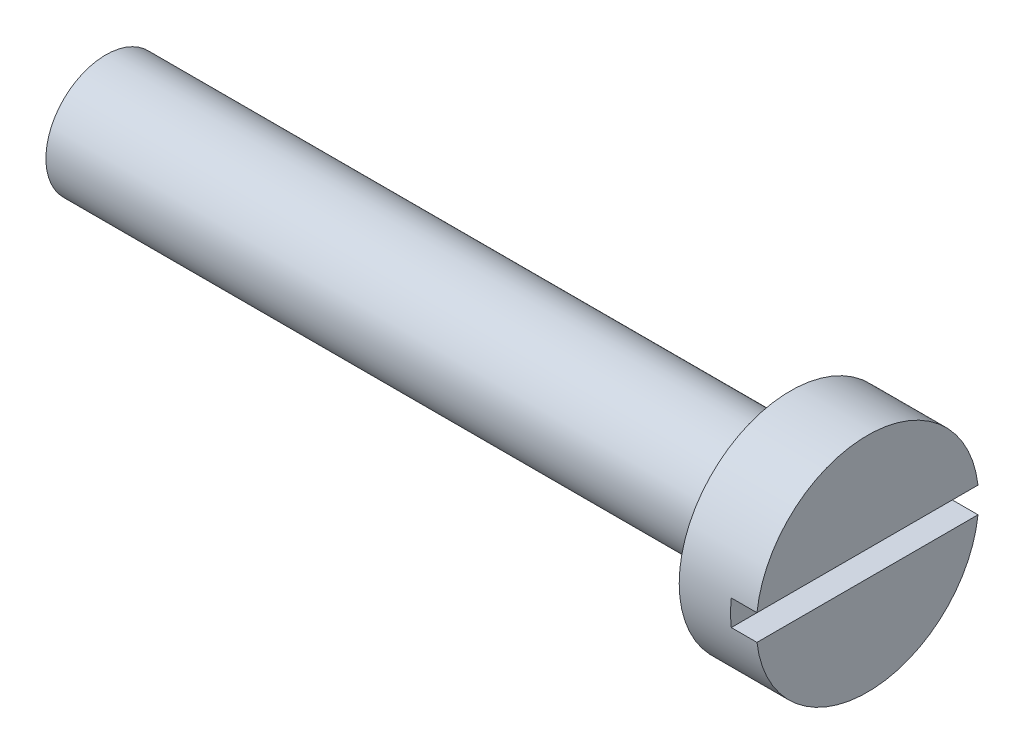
ISO-10303-21;
HEADER;
FILE_DESCRIPTION(('STEP AP214'),'2;1');
FILE_NAME('part.step','',(''),(''),'','','');
FILE_SCHEMA(('AUTOMOTIVE_DESIGN { 1 0 10303 214 1 1 1 1 }'));
ENDSEC;
DATA;
#1=APPLICATION_CONTEXT('core data for automotive mechanical design processes');
#2=APPLICATION_PROTOCOL_DEFINITION('international standard','automotive_design',2000,#1);
#3=PRODUCT_CONTEXT('',#1,'mechanical');
#4=PRODUCT('Part','Part','',(#3));
#5=PRODUCT_RELATED_PRODUCT_CATEGORY('part','',(#4));
#6=PRODUCT_DEFINITION_FORMATION('','',#4);
#7=PRODUCT_DEFINITION_CONTEXT('part definition',#1,'design');
#8=PRODUCT_DEFINITION('design','',#6,#7);
#9=PRODUCT_DEFINITION_SHAPE('','',#8);
#10=(LENGTH_UNIT() NAMED_UNIT(*) SI_UNIT(.MILLI.,.METRE.));
#11=(NAMED_UNIT(*) PLANE_ANGLE_UNIT() SI_UNIT($,.RADIAN.));
#12=(NAMED_UNIT(*) SI_UNIT($,.STERADIAN.) SOLID_ANGLE_UNIT());
#13=UNCERTAINTY_MEASURE_WITH_UNIT(LENGTH_MEASURE(1.E-05),#10,'distance_accuracy_value','');
#14=(GEOMETRIC_REPRESENTATION_CONTEXT(3) GLOBAL_UNCERTAINTY_ASSIGNED_CONTEXT((#13)) GLOBAL_UNIT_ASSIGNED_CONTEXT((#10,
#11,#12)) REPRESENTATION_CONTEXT('',''));
#15=CARTESIAN_POINT('',(0.,0.,0.));
#16=DIRECTION('',(0.,0.,1.));
#17=DIRECTION('',(1.,0.,0.));
#18=AXIS2_PLACEMENT_3D('',#15,#16,#17);
#19=CARTESIAN_POINT('',(0.,0.,0.));
#20=DIRECTION('',(1.,0.,0.));
#21=DIRECTION('',(0.,0.,-1.));
#22=AXIS2_PLACEMENT_3D('',#19,#20,#21);
#23=PLANE('',#22);
#24=DIRECTION('',(0.,0.,1.));
#25=VECTOR('',#24,1.);
#26=CARTESIAN_POINT('',(0.,0.15,-1.3));
#27=LINE('',#26,#25);
#28=CARTESIAN_POINT('',(0.,0.15,-1.2913171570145));
#29=VERTEX_POINT('',#28);
#30=CARTESIAN_POINT('',(0.,0.15,1.2913171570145));
#31=VERTEX_POINT('',#30);
#32=EDGE_CURVE('E84',#29,#31,#27,.T.);
#33=ORIENTED_EDGE('',*,*,#32,.F.);
#34=CARTESIAN_POINT('',(0.,0.,0.));
#35=DIRECTION('',(1.,0.,0.));
#36=DIRECTION('',(0.,0.,-1.));
#37=AXIS2_PLACEMENT_3D('',#34,#35,#36);
#38=CIRCLE('',#37,1.3);
#39=EDGE_CURVE('E93',#29,#31,#38,.T.);
#40=ORIENTED_EDGE('',*,*,#39,.T.);
#41=EDGE_LOOP('',(#33,#40));
#42=FACE_BOUND('',#41,.T.);
#43=ADVANCED_FACE('F35',(#42),#23,.T.);
#44=DIRECTION('',(0.,0.,1.));
#45=VECTOR('',#44,1.);
#46=CARTESIAN_POINT('',(0.,-0.15,-1.3));
#47=LINE('',#46,#45);
#48=CARTESIAN_POINT('',(0.,-0.15,-1.2913171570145));
#49=VERTEX_POINT('',#48);
#50=CARTESIAN_POINT('',(0.,-0.15,1.2913171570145));
#51=VERTEX_POINT('',#50);
#52=EDGE_CURVE('E77',#49,#51,#47,.T.);
#53=ORIENTED_EDGE('',*,*,#52,.T.);
#54=EDGE_CURVE('E90',#51,#49,#38,.T.);
#55=ORIENTED_EDGE('',*,*,#54,.T.);
#56=EDGE_LOOP('',(#53,#55));
#57=FACE_BOUND('',#56,.T.);
#58=ADVANCED_FACE('F37',(#57),#23,.T.);
#59=CARTESIAN_POINT('',(0.,0.,0.));
#60=DIRECTION('',(1.,0.,0.));
#61=DIRECTION('',(0.,0.,-1.));
#62=AXIS2_PLACEMENT_3D('',#59,#60,#61);
#63=CYLINDRICAL_SURFACE('',#62,1.3);
#64=CARTESIAN_POINT('',(-0.3,0.,0.));
#65=DIRECTION('',(-1.,0.,0.));
#66=DIRECTION('',(0.,0.,1.));
#67=AXIS2_PLACEMENT_3D('',#64,#65,#66);
#68=CIRCLE('',#67,1.3);
#69=CARTESIAN_POINT('',(-0.3,-0.15,-1.2913171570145));
#70=VERTEX_POINT('',#69);
#71=CARTESIAN_POINT('',(-0.3,0.15,-1.2913171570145));
#72=VERTEX_POINT('',#71);
#73=EDGE_CURVE('E92',#70,#72,#68,.F.);
#74=ORIENTED_EDGE('',*,*,#73,.F.);
#75=DIRECTION('',(1.,0.,0.));
#76=VECTOR('',#75,1.);
#77=CARTESIAN_POINT('',(0.,-0.15,-1.2913171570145));
#78=LINE('',#77,#76);
#79=EDGE_CURVE('E11',#49,#70,#78,.F.);
#80=ORIENTED_EDGE('',*,*,#79,.F.);
#81=ORIENTED_EDGE('',*,*,#54,.F.);
#82=DIRECTION('',(1.,0.,0.));
#83=VECTOR('',#82,1.);
#84=CARTESIAN_POINT('',(0.,-0.15,1.2913171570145));
#85=LINE('',#84,#83);
#86=CARTESIAN_POINT('',(-0.3,-0.15,1.2913171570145));
#87=VERTEX_POINT('',#86);
#88=EDGE_CURVE('E43',#87,#51,#85,.T.);
#89=ORIENTED_EDGE('',*,*,#88,.F.);
#90=CARTESIAN_POINT('',(-0.3,0.15,1.2913171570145));
#91=VERTEX_POINT('',#90);
#92=EDGE_CURVE('E50',#91,#87,#68,.F.);
#93=ORIENTED_EDGE('',*,*,#92,.F.);
#94=DIRECTION('',(1.,0.,0.));
#95=VECTOR('',#94,1.);
#96=CARTESIAN_POINT('',(0.,0.15,1.2913171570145));
#97=LINE('',#96,#95);
#98=EDGE_CURVE('E58',#31,#91,#97,.F.);
#99=ORIENTED_EDGE('',*,*,#98,.F.);
#100=ORIENTED_EDGE('',*,*,#39,.F.);
#101=DIRECTION('',(1.,0.,0.));
#102=VECTOR('',#101,1.);
#103=CARTESIAN_POINT('',(0.,0.15,-1.2913171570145));
#104=LINE('',#103,#102);
#105=EDGE_CURVE('E104',#72,#29,#104,.T.);
#106=ORIENTED_EDGE('',*,*,#105,.F.);
#107=EDGE_LOOP('',(#74,#80,#81,#89,#93,#99,#100,#106));
#108=FACE_BOUND('',#107,.T.);
#109=CARTESIAN_POINT('',(-0.9,0.,0.));
#110=DIRECTION('',(1.,0.,0.));
#111=DIRECTION('',(0.,0.,-1.));
#112=AXIS2_PLACEMENT_3D('',#109,#110,#111);
#113=CIRCLE('',#112,1.3);
#114=CARTESIAN_POINT('',(-0.9,0.,-1.3));
#115=VERTEX_POINT('',#114);
#116=EDGE_CURVE('E94',#115,#115,#113,.T.);
#117=ORIENTED_EDGE('',*,*,#116,.T.);
#118=EDGE_LOOP('',(#117));
#119=FACE_BOUND('',#118,.T.);
#120=ADVANCED_FACE('F88',(#108,#119),#63,.T.);
#121=CARTESIAN_POINT('',(-0.9,1.3,0.));
#122=DIRECTION('',(-1.,0.,0.));
#123=DIRECTION('',(0.,0.,1.));
#124=AXIS2_PLACEMENT_3D('',#121,#122,#123);
#125=PLANE('',#124);
#126=CARTESIAN_POINT('',(-0.9,0.,0.));
#127=DIRECTION('',(1.,0.,0.));
#128=DIRECTION('',(0.,0.,-1.));
#129=AXIS2_PLACEMENT_3D('',#126,#127,#128);
#130=CIRCLE('',#129,0.7);
#131=CARTESIAN_POINT('',(-0.9,0.,-0.7));
#132=VERTEX_POINT('',#131);
#133=EDGE_CURVE('E98',#132,#132,#130,.T.);
#134=ORIENTED_EDGE('',*,*,#133,.T.);
#135=EDGE_LOOP('',(#134));
#136=FACE_BOUND('',#135,.T.);
#137=ORIENTED_EDGE('',*,*,#116,.F.);
#138=EDGE_LOOP('',(#137));
#139=FACE_BOUND('',#138,.T.);
#140=ADVANCED_FACE('F120',(#136,#139),#125,.T.);
#141=CARTESIAN_POINT('',(0.,0.,0.));
#142=DIRECTION('',(1.,0.,0.));
#143=DIRECTION('',(0.,0.,-1.));
#144=AXIS2_PLACEMENT_3D('',#141,#142,#143);
#145=CYLINDRICAL_SURFACE('',#144,0.699999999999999);
#146=CARTESIAN_POINT('',(-8.9,0.,0.));
#147=DIRECTION('',(1.,0.,0.));
#148=DIRECTION('',(0.,0.,-1.));
#149=AXIS2_PLACEMENT_3D('',#146,#147,#148);
#150=CIRCLE('',#149,0.699999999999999);
#151=CARTESIAN_POINT('',(-8.9,0.,-0.699999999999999));
#152=VERTEX_POINT('',#151);
#153=EDGE_CURVE('E109',#152,#152,#150,.T.);
#154=ORIENTED_EDGE('',*,*,#153,.T.);
#155=EDGE_LOOP('',(#154));
#156=FACE_BOUND('',#155,.T.);
#157=ORIENTED_EDGE('',*,*,#133,.F.);
#158=EDGE_LOOP('',(#157));
#159=FACE_BOUND('',#158,.T.);
#160=ADVANCED_FACE('F123',(#156,#159),#145,.T.);
#161=CARTESIAN_POINT('',(-8.9,0.699999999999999,0.));
#162=DIRECTION('',(-1.,0.,0.));
#163=DIRECTION('',(0.,0.,1.));
#164=AXIS2_PLACEMENT_3D('',#161,#162,#163);
#165=PLANE('',#164);
#166=ORIENTED_EDGE('',*,*,#153,.F.);
#167=EDGE_LOOP('',(#166));
#168=FACE_BOUND('',#167,.T.);
#169=ADVANCED_FACE('F125',(#168),#165,.T.);
#170=CARTESIAN_POINT('',(-0.3,0.15,-1.3));
#171=DIRECTION('',(-1.,0.,0.));
#172=DIRECTION('',(0.,0.,1.));
#173=AXIS2_PLACEMENT_3D('',#170,#171,#172);
#174=PLANE('',#173);
#175=DIRECTION('',(0.,0.,1.));
#176=VECTOR('',#175,1.);
#177=CARTESIAN_POINT('',(-0.3,-0.15,-1.3));
#178=LINE('',#177,#176);
#179=EDGE_CURVE('E85',#70,#87,#178,.T.);
#180=ORIENTED_EDGE('',*,*,#179,.F.);
#181=ORIENTED_EDGE('',*,*,#73,.T.);
#182=DIRECTION('',(0.,0.,1.));
#183=VECTOR('',#182,1.);
#184=CARTESIAN_POINT('',(-0.3,0.15,-1.3));
#185=LINE('',#184,#183);
#186=EDGE_CURVE('E107',#72,#91,#185,.T.);
#187=ORIENTED_EDGE('',*,*,#186,.T.);
#188=ORIENTED_EDGE('',*,*,#92,.T.);
#189=EDGE_LOOP('',(#180,#181,#187,#188));
#190=FACE_BOUND('',#189,.T.);
#191=ADVANCED_FACE('F106',(#190),#174,.F.);
#192=CARTESIAN_POINT('',(-0.3,0.15,-1.3));
#193=DIRECTION('',(0.,1.,0.));
#194=DIRECTION('',(-1.,0.,0.));
#195=AXIS2_PLACEMENT_3D('',#192,#193,#194);
#196=PLANE('',#195);
#197=ORIENTED_EDGE('',*,*,#98,.T.);
#198=ORIENTED_EDGE('',*,*,#186,.F.);
#199=ORIENTED_EDGE('',*,*,#105,.T.);
#200=ORIENTED_EDGE('',*,*,#32,.T.);
#201=EDGE_LOOP('',(#197,#198,#199,#200));
#202=FACE_BOUND('',#201,.T.);
#203=ADVANCED_FACE('F108',(#202),#196,.F.);
#204=CARTESIAN_POINT('',(-0.3,-0.15,-1.3));
#205=DIRECTION('',(0.,-1.,0.));
#206=DIRECTION('',(1.,0.,0.));
#207=AXIS2_PLACEMENT_3D('',#204,#205,#206);
#208=PLANE('',#207);
#209=ORIENTED_EDGE('',*,*,#79,.T.);
#210=ORIENTED_EDGE('',*,*,#179,.T.);
#211=ORIENTED_EDGE('',*,*,#88,.T.);
#212=ORIENTED_EDGE('',*,*,#52,.F.);
#213=EDGE_LOOP('',(#209,#210,#211,#212));
#214=FACE_BOUND('',#213,.T.);
#215=ADVANCED_FACE('F79',(#214),#208,.F.);
#216=CLOSED_SHELL('',(#43,#58,#120,#140,#160,#169,#191,#203,#215));
#217=MANIFOLD_SOLID_BREP('B2',#216);
#218=ADVANCED_BREP_SHAPE_REPRESENTATION('',(#18,#217),#14);
#219=SHAPE_DEFINITION_REPRESENTATION(#9,#218);
ENDSEC;
END-ISO-10303-21;
